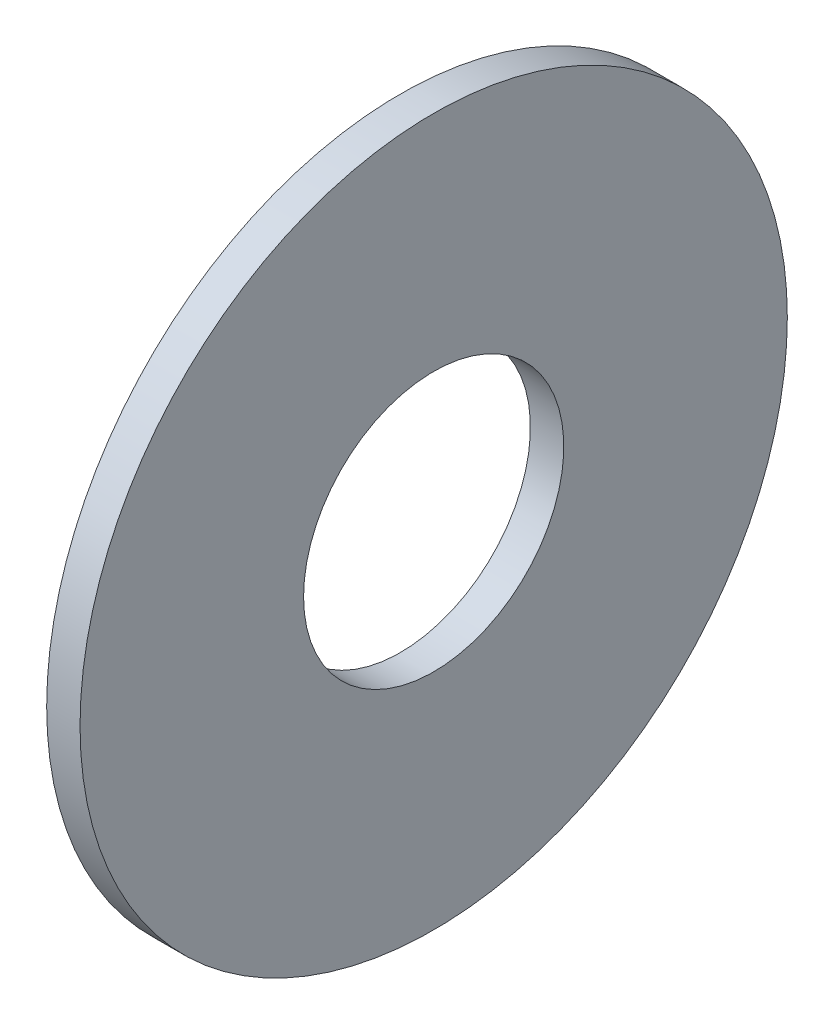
ISO-10303-21;
HEADER;
FILE_DESCRIPTION(('STEP AP214'),'2;1');
FILE_NAME('part.step','',(''),(''),'','','');
FILE_SCHEMA(('AUTOMOTIVE_DESIGN { 1 0 10303 214 1 1 1 1 }'));
ENDSEC;
DATA;
#1=APPLICATION_CONTEXT('core data for automotive mechanical design processes');
#2=APPLICATION_PROTOCOL_DEFINITION('international standard','automotive_design',2000,#1);
#3=PRODUCT_CONTEXT('',#1,'mechanical');
#4=PRODUCT('Part','Part','',(#3));
#5=PRODUCT_RELATED_PRODUCT_CATEGORY('part','',(#4));
#6=PRODUCT_DEFINITION_FORMATION('','',#4);
#7=PRODUCT_DEFINITION_CONTEXT('part definition',#1,'design');
#8=PRODUCT_DEFINITION('design','',#6,#7);
#9=PRODUCT_DEFINITION_SHAPE('','',#8);
#10=(LENGTH_UNIT() NAMED_UNIT(*) SI_UNIT(.MILLI.,.METRE.));
#11=(NAMED_UNIT(*) PLANE_ANGLE_UNIT() SI_UNIT($,.RADIAN.));
#12=(NAMED_UNIT(*) SI_UNIT($,.STERADIAN.) SOLID_ANGLE_UNIT());
#13=UNCERTAINTY_MEASURE_WITH_UNIT(LENGTH_MEASURE(1.E-05),#10,'distance_accuracy_value','');
#14=(GEOMETRIC_REPRESENTATION_CONTEXT(3) GLOBAL_UNCERTAINTY_ASSIGNED_CONTEXT((#13)) GLOBAL_UNIT_ASSIGNED_CONTEXT((#10,
#11,#12)) REPRESENTATION_CONTEXT('',''));
#15=CARTESIAN_POINT('',(0.,0.,0.));
#16=DIRECTION('',(0.,0.,1.));
#17=DIRECTION('',(1.,0.,0.));
#18=AXIS2_PLACEMENT_3D('',#15,#16,#17);
#19=CARTESIAN_POINT('',(0.,0.,0.));
#20=DIRECTION('',(-1.,0.,0.));
#21=DIRECTION('',(0.,0.,1.));
#22=AXIS2_PLACEMENT_3D('',#19,#20,#21);
#23=CYLINDRICAL_SURFACE('',#22,265.);
#24=CARTESIAN_POINT('',(0.,0.,0.));
#25=DIRECTION('',(-1.,0.,0.));
#26=DIRECTION('',(0.,0.,1.));
#27=AXIS2_PLACEMENT_3D('',#24,#25,#26);
#28=CIRCLE('',#27,265.);
#29=CARTESIAN_POINT('',(0.,0.,265.));
#30=VERTEX_POINT('',#29);
#31=EDGE_CURVE('E10',#30,#30,#28,.T.);
#32=ORIENTED_EDGE('',*,*,#31,.F.);
#33=EDGE_LOOP('',(#32));
#34=FACE_BOUND('',#33,.T.);
#35=CARTESIAN_POINT('',(25.,0.,0.));
#36=DIRECTION('',(-1.,0.,0.));
#37=DIRECTION('',(0.,0.,1.));
#38=AXIS2_PLACEMENT_3D('',#35,#36,#37);
#39=CIRCLE('',#38,265.);
#40=CARTESIAN_POINT('',(25.,0.,265.));
#41=VERTEX_POINT('',#40);
#42=EDGE_CURVE('E43',#41,#41,#39,.T.);
#43=ORIENTED_EDGE('',*,*,#42,.T.);
#44=EDGE_LOOP('',(#43));
#45=FACE_BOUND('',#44,.T.);
#46=ADVANCED_FACE('F29',(#34,#45),#23,.T.);
#47=CARTESIAN_POINT('',(0.,97.5,0.));
#48=DIRECTION('',(1.,0.,0.));
#49=DIRECTION('',(0.,0.,-1.));
#50=AXIS2_PLACEMENT_3D('',#47,#48,#49);
#51=PLANE('',#50);
#52=CARTESIAN_POINT('',(0.,0.,0.));
#53=DIRECTION('',(-1.,0.,0.));
#54=DIRECTION('',(0.,0.,1.));
#55=AXIS2_PLACEMENT_3D('',#52,#53,#54);
#56=CIRCLE('',#55,97.5);
#57=CARTESIAN_POINT('',(0.,0.,97.5));
#58=VERTEX_POINT('',#57);
#59=EDGE_CURVE('E35',#58,#58,#56,.T.);
#60=ORIENTED_EDGE('',*,*,#59,.F.);
#61=EDGE_LOOP('',(#60));
#62=FACE_BOUND('',#61,.T.);
#63=ORIENTED_EDGE('',*,*,#31,.T.);
#64=EDGE_LOOP('',(#63));
#65=FACE_BOUND('',#64,.T.);
#66=ADVANCED_FACE('F58',(#62,#65),#51,.F.);
#67=CARTESIAN_POINT('',(0.,0.,0.));
#68=DIRECTION('',(-1.,0.,0.));
#69=DIRECTION('',(0.,0.,1.));
#70=AXIS2_PLACEMENT_3D('',#67,#68,#69);
#71=CYLINDRICAL_SURFACE('',#70,97.5);
#72=CARTESIAN_POINT('',(25.,0.,0.));
#73=DIRECTION('',(-1.,0.,0.));
#74=DIRECTION('',(0.,0.,1.));
#75=AXIS2_PLACEMENT_3D('',#72,#73,#74);
#76=CIRCLE('',#75,97.5);
#77=CARTESIAN_POINT('',(25.,0.,97.5));
#78=VERTEX_POINT('',#77);
#79=EDGE_CURVE('E39',#78,#78,#76,.T.);
#80=ORIENTED_EDGE('',*,*,#79,.F.);
#81=EDGE_LOOP('',(#80));
#82=FACE_BOUND('',#81,.T.);
#83=ORIENTED_EDGE('',*,*,#59,.T.);
#84=EDGE_LOOP('',(#83));
#85=FACE_BOUND('',#84,.T.);
#86=ADVANCED_FACE('F53',(#82,#85),#71,.F.);
#87=CARTESIAN_POINT('',(25.,265.,0.));
#88=DIRECTION('',(-1.,0.,0.));
#89=DIRECTION('',(0.,0.,1.));
#90=AXIS2_PLACEMENT_3D('',#87,#88,#89);
#91=PLANE('',#90);
#92=ORIENTED_EDGE('',*,*,#42,.F.);
#93=EDGE_LOOP('',(#92));
#94=FACE_BOUND('',#93,.T.);
#95=ORIENTED_EDGE('',*,*,#79,.T.);
#96=EDGE_LOOP('',(#95));
#97=FACE_BOUND('',#96,.T.);
#98=ADVANCED_FACE('F50',(#94,#97),#91,.F.);
#99=CLOSED_SHELL('',(#46,#66,#86,#98));
#100=MANIFOLD_SOLID_BREP('B2',#99);
#101=ADVANCED_BREP_SHAPE_REPRESENTATION('',(#18,#100),#14);
#102=SHAPE_DEFINITION_REPRESENTATION(#9,#101);
ENDSEC;
END-ISO-10303-21;
